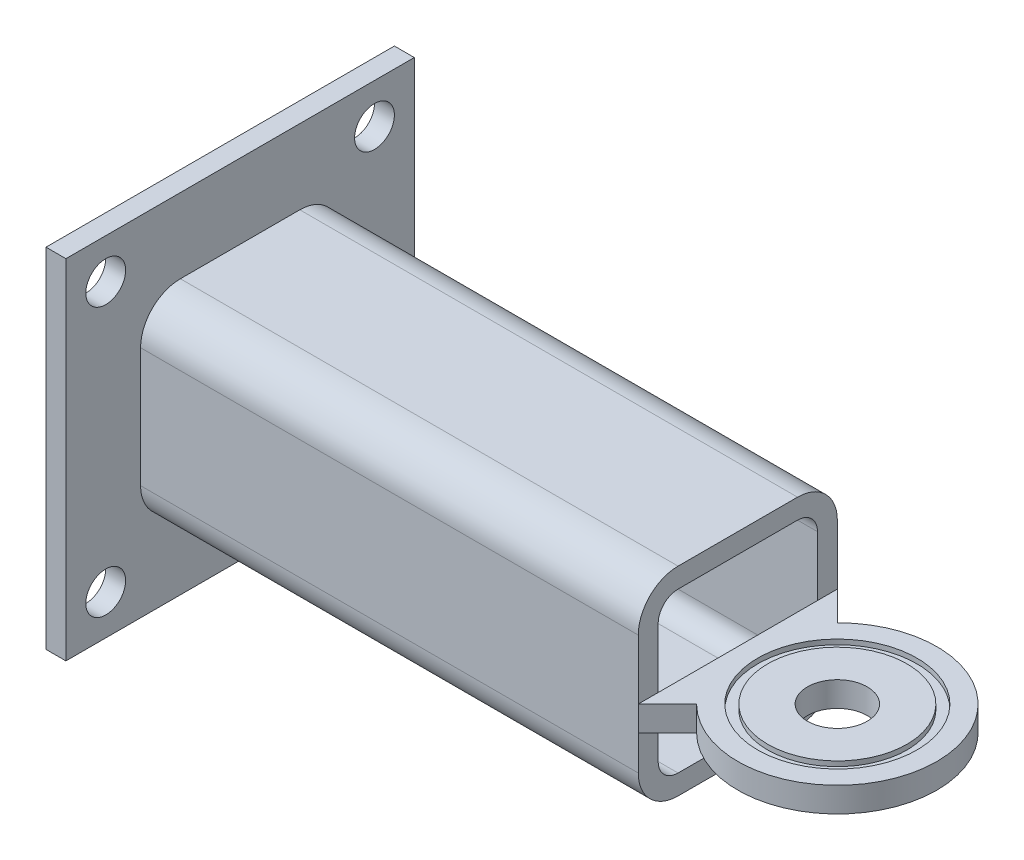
from build123d import *
from build123d.topology import SkipClean

# Parameters (mm, degrees)
SQUARE_TUBE_20_X_20_X_2_1_DEPTH = 50
SKETCH12_W                      = 20
SKETCH12_H                      = 2.5
BOSS_EXTRUDE1_DEPTH             = 20
CUT_EXTRUDE1_DEPTH              = 20
CUT_EXTRUDE2_DEPTH              = 20
SKETCH17_R                      = 3
CUT_EXTRUDE3_DEPTH              = 20
SKETCH18_R                      = 8
SKETCH18_R_2                    = 7
CUT_EXTRUDE4_DEPTH              = 0.5
CUT_EXTRUDE5_START              = -0.2
SKETCH19_R                      = 8
SKETCH19_R_2                    = 7
CUT_EXTRUDE5_DEPTH              = 0.2
SKETCH20_W                      = 35
SKETCH20_H                      = 35
BOSS_EXTRUDE2_DEPTH             = 2
SKETCH21_R                      = 2
CUT_EXTRUDE6_DEPTH              = 2


with BuildPart() as part:
    # Sketch11 → Square tube 20 X 20 X 2_1 (new body)
    with BuildSketch(Plane(origin=(-27.324380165, 0, 0), x_dir=(0, 0, -1), z_dir=(1, 0, 0))):
        with BuildLine():
            Line((-6, -10), (6, -10))
            ThreePointArc((6, -10), (8.828427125, -8.828427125), (10, -6))
            Line((10, -6), (10, 6))
            ThreePointArc((10, 6), (8.828427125, 8.828427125), (6, 10))
            Line((6, 10), (-6, 10))
            ThreePointArc((-6, 10), (-8.828427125, 8.828427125), (-10, 6))
            Line((-10, 6), (-10, -6))
            ThreePointArc((-10, -6), (-8.828427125, -8.828427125), (-6, -10))
        make_face()
        with BuildLine():
            Line((-6, -8), (6, -8))
            ThreePointArc((6, -8), (7.414213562, -7.414213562), (8, -6))
            Line((8, -6), (8, 6))
            ThreePointArc((8, 6), (7.414213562, 7.414213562), (6, 8))
            Line((6, 8), (-6, 8))
            ThreePointArc((-6, 8), (-7.414213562, 7.414213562), (-8, 6))
            Line((-8, 6), (-8, -6))
            ThreePointArc((-8, -6), (-7.414213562, -7.414213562), (-6, -8))
        make_face(mode=Mode.SUBTRACT)
    extrude(amount=SQUARE_TUBE_20_X_20_X_2_1_DEPTH)

    # Sketch12 → Boss-Extrude1 (add)
    with BuildSketch(Plane(origin=(22.675619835, 0, 0), x_dir=(0, 0, -1), z_dir=(1, 0, 0))):
        with Locations((0, -1.25)):
            Rectangle(SKETCH12_W, SKETCH12_H)
    extrude(amount=BOSS_EXTRUDE1_DEPTH)

    # Sketch15 → Cut-Extrude1 (cut)
    with BuildSketch(Plane(origin=(0, 0, 0), x_dir=(1, 0, 0), z_dir=(0, 1, 0))):
        with BuildLine():
            Line((42.675619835, -10), (42.675619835, 0))
            ThreePointArc((42.675619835, 0), (39.746687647, -7.071067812), (32.675619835, -10))
            Line((32.675619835, -10), (42.675619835, -10))
        make_face()
        with BuildLine():
            Line((42.675619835, 10), (32.675619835, 10))
            ThreePointArc((32.675619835, 10), (39.746687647, 7.071067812), (42.675619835, 0))
            Line((42.675619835, 0), (42.675619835, 10))
        make_face()
    extrude(amount=-CUT_EXTRUDE1_DEPTH, mode=Mode.SUBTRACT)

    # Sketch16 → Cut-Extrude2 (cut)
    with SkipClean():  # the faces are left unmerged after this step: merging them gives an invalid solid
        with BuildSketch(Plane(origin=(0, 0, 0), x_dir=(1, 0, 0), z_dir=(0, 1, 0))):
            with BuildLine():
                Line((25.604552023, 7.071067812), (22.675619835, 10))
                Line((22.675619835, 10), (32.675619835, 10))
                ThreePointArc((32.675619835, 10), (28.848785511, 9.238795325), (25.604552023, 7.071067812))
            make_face()
            with BuildLine():
                Line((25.604552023, -7.071067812), (22.675619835, -10))
                Line((22.675619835, -10), (32.675619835, -10))
                ThreePointArc((32.675619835, -10), (28.848785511, -9.238795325), (25.604552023, -7.071067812))
            make_face()
        extrude(amount=-CUT_EXTRUDE2_DEPTH, mode=Mode.SUBTRACT)

    # Sketch17 → Cut-Extrude3 (cut)
    with BuildSketch(Plane(origin=(0, 0, 0), x_dir=(1, 0, 0), z_dir=(0, 1, 0))):
        with Locations(Location((32.675619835, 0, 0), (0, 0, 270))):
            Circle(SKETCH17_R)
    extrude(amount=-CUT_EXTRUDE3_DEPTH, mode=Mode.SUBTRACT)

    # Sketch18 → Cut-Extrude4 (cut)
    with BuildSketch(Plane(origin=(0, 0, 0), x_dir=(1, 0, 0), z_dir=(0, 1, 0))):
        with Locations(Location((32.675619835, 0, 0), (0, 0, 270))):
            Circle(SKETCH18_R)
        with Locations(Location((32.675619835, 0, 0), (0, 0, 270))):
            Circle(SKETCH18_R_2, mode=Mode.SUBTRACT)
    extrude(amount=-CUT_EXTRUDE4_DEPTH, mode=Mode.SUBTRACT)

    # Sketch19 → Cut-Extrude5 (cut)
    with BuildSketch(Plane.XZ.offset(2.5).offset(CUT_EXTRUDE5_START)):
        with Locations(Location((32.675619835, 0, 0), (0, 0, 90))):
            Circle(SKETCH19_R)
        with Locations(Location((32.675619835, 0, 0), (0, 0, 90))):
            Circle(SKETCH19_R_2, mode=Mode.SUBTRACT)
    extrude(amount=CUT_EXTRUDE5_DEPTH, mode=Mode.SUBTRACT)

    # Sketch20 → Boss-Extrude2 (add)
    with SkipClean():  # the faces are left unmerged after this step: merging them gives an invalid solid
        with BuildSketch(Plane.ZY.offset(27.324380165)):
            Rectangle(SKETCH20_W, SKETCH20_H)
        extrude(amount=BOSS_EXTRUDE2_DEPTH)

    # Sketch21 → Cut-Extrude6 (cut)
    with BuildSketch(Plane(origin=(-27.324380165, 0, 0), x_dir=(0, 0, -1), z_dir=(1, 0, 0))):
        with Locations((13.5, 13.5)):
            Circle(SKETCH21_R)
        with Locations((13.5, -13.5)):
            Circle(SKETCH21_R)
        with Locations((-13.5, -13.5)):
            Circle(SKETCH21_R)
        with Locations((-13.5, 13.5)):
            Circle(SKETCH21_R)
    extrude(amount=-CUT_EXTRUDE6_DEPTH, mode=Mode.SUBTRACT)


solid = part.part
